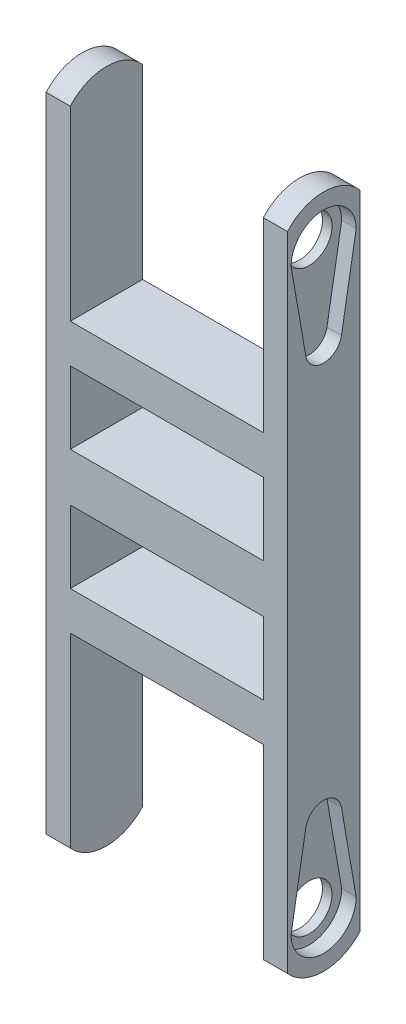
from build123d import *

# Parameters (mm, degrees)
SKETCH1_W           = 60
SKETCH1_H           = 140
BOSS_EXTRUDE1_DEPTH = 15
SKETCH2_W           = 40.05
SKETCH2_H           = 42
CUT_EXTRUDE1_DEPTH  = 78.620873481
SKETCH3_W           = 40.05
SKETCH3_H           = 15
CUT_EXTRUDE2_DEPTH  = 78.620873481
CUT_EXTRUDE3_DEPTH  = 94.407708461
CUT_EXTRUDE4_REACH  = 95.408
SKETCH5_R           = 4.75
SKETCH6_W           = 4.9875
SKETCH6_H           = 140
CUT_EXTRUDE5_DEPTH  = 78.620873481
CUT_EXTRUDE6_DEPTH  = 3


with BuildPart() as part:
    # Sketch1 → Boss-Extrude1 (new body)
    with BuildSketch(Plane.XY):
        Rectangle(SKETCH1_W, SKETCH1_H)
    extrude(amount=BOSS_EXTRUDE1_DEPTH)

    # Sketch2 → Cut-Extrude1 (cut, through all)
    with BuildSketch(Plane.XY.offset(15)):
        with Locations((0, 49)):
            Rectangle(SKETCH2_W, SKETCH2_H)
        with Locations((0, -49)):
            Rectangle(SKETCH2_W, SKETCH2_H)
    extrude(amount=-CUT_EXTRUDE1_DEPTH, mode=Mode.SUBTRACT)

    # Sketch3 → Cut-Extrude2 (cut, through all)
    with BuildSketch(Plane.XY.offset(15)):
        with Locations((0, -12.5)):
            Rectangle(SKETCH3_W, SKETCH3_H)
        with Locations((0, 12.5)):
            Rectangle(SKETCH3_W, SKETCH3_H)
    extrude(amount=-CUT_EXTRUDE2_DEPTH, mode=Mode.SUBTRACT)

    # Sketch4 → Cut-Extrude3 (cut, through all)
    with BuildSketch(Plane.ZY.offset(30)):
        with BuildLine():
            Line((17.5, 60), (21.5, 60))
            Line((21.5, 60), (21.5, 90))
            Line((21.5, 90), (-6.5, 90))
            Line((-6.5, 90), (-6.5, 60))
            Line((-6.5, 60), (-2.5, 60))
            ThreePointArc((-2.5, 60), (7.5, 70), (17.5, 60))
        make_face()
        with BuildLine():
            Line((-6.5, -60), (-6.5, -90))
            Line((-6.5, -90), (21.5, -90))
            Line((21.5, -90), (21.5, -60))
            Line((21.5, -60), (17.5, -60))
            ThreePointArc((17.5, -60), (7.5, -70), (-2.5, -60))
            Line((-2.5, -60), (-6.5, -60))
        make_face()
    extrude(amount=-CUT_EXTRUDE3_DEPTH, mode=Mode.SUBTRACT)

    # Sketch5 → Cut-Extrude4 (cut, up to next)
    with BuildSketch(Plane(origin=(30, 0, 0), x_dir=(0, 0, -1), z_dir=(1, 0, 0)), mode=Mode.PRIVATE) as cut_extrude4_sk1:
        with Locations((-7.5, 60)):
            Circle(SKETCH5_R)
    cut_extrude4_tool1 = extrude(cut_extrude4_sk1.sketch, amount=-CUT_EXTRUDE4_REACH, mode=Mode.PRIVATE) & part.part
    # Sketch5 → Cut-Extrude4 (cut, up to next)
    with BuildSketch(Plane(origin=(30, 0, 0), x_dir=(0, 0, -1), z_dir=(1, 0, 0)), mode=Mode.PRIVATE) as cut_extrude4_sk2:
        with Locations(Location((-7.5, -60, 0), (0, 0, 90))):
            Circle(SKETCH5_R)
    cut_extrude4_tool2 = extrude(cut_extrude4_sk2.sketch, amount=-CUT_EXTRUDE4_REACH, mode=Mode.PRIVATE) & part.part
    add(cut_extrude4_tool1.solids().sort_by_distance((30, 60, 7.5))[0], mode=Mode.SUBTRACT)
    add(cut_extrude4_tool2.solids().sort_by_distance((30, -60, 7.5))[0], mode=Mode.SUBTRACT)

    # Sketch6 → Cut-Extrude5 (cut, through all)
    with BuildSketch(Plane(origin=(0, 0, 0), x_dir=(-1, 0, 0), z_dir=(0, 0, -1))):
        with Locations((27.50625, 0)):
            Rectangle(SKETCH6_W, SKETCH6_H)
        with Locations((-27.50625, 0)):
            Rectangle(SKETCH6_W, SKETCH6_H)
    extrude(amount=-CUT_EXTRUDE5_DEPTH, mode=Mode.SUBTRACT)

    # Sketch7 → Cut-Extrude6 (cut)
    with BuildSketch(Plane(origin=(25.0125, 0, 0), x_dir=(0, 0, -1), z_dir=(1, 0, 0))):
        with BuildLine():
            Line((-14.25, 60), (-11.194996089, 42.360075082))
            ThreePointArc((-11.194996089, 42.360075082), (-7.5, 39.25), (-3.805003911, 42.360075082))
            Line((-3.805003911, 42.360075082), (-0.75, 60))
            ThreePointArc((-0.75, 60), (-7.5, 66.75), (-14.25, 60))
        make_face()
        with BuildLine():
            Line((-0.75, -60), (-3.805003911, -42.360075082))
            ThreePointArc((-3.805003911, -42.360075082), (-7.5, -39.25), (-11.194996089, -42.360075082))
            Line((-11.194996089, -42.360075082), (-14.25, -60))
            ThreePointArc((-14.25, -60), (-7.5, -66.75), (-0.75, -60))
        make_face()
    extrude(amount=-CUT_EXTRUDE6_DEPTH, mode=Mode.SUBTRACT)


solid = part.part
